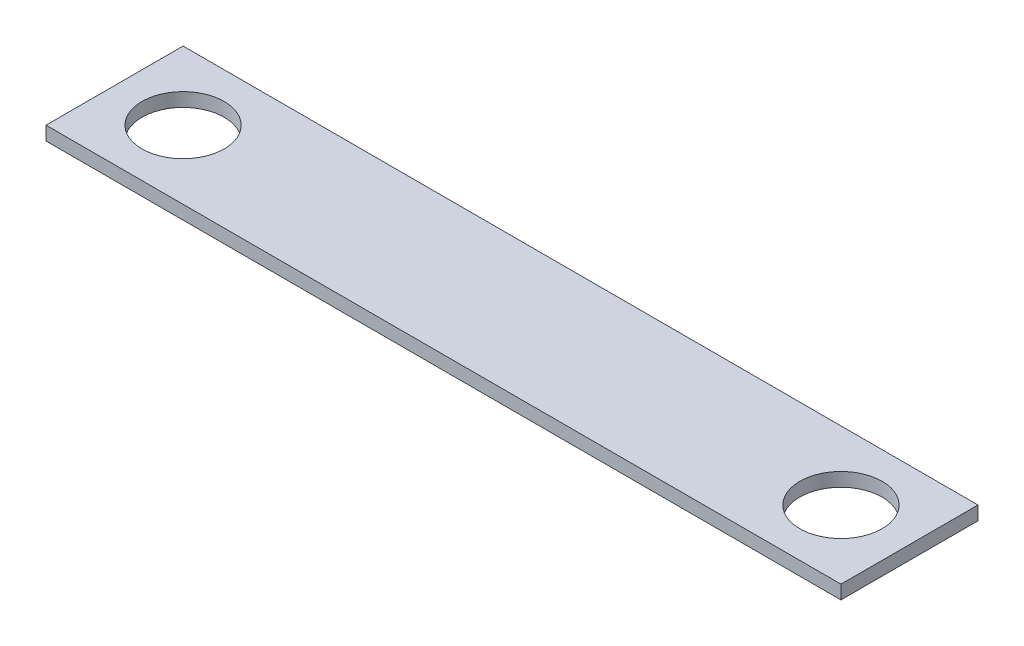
from build123d import *

# Parameters (mm, degrees)
SKETCH_1_W          = 29
SKETCH_1_H          = 5
EXTRUDE_1_DEPTH     = 0.5
SKETCH_2_R          = 1.5
CUT_EXTRUDE_1_DEPTH = 30.432125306


with BuildPart() as part:
    # Sketch 1 → Extrude 1 (new body)
    with BuildSketch(Plane(origin=(0, 0, 0), x_dir=(1, 0, 0), z_dir=(0, 1, 0))):
        with Locations((14.5, 2.5)):
            Rectangle(SKETCH_1_W, SKETCH_1_H)
    extrude(amount=EXTRUDE_1_DEPTH)

    # Sketch 2 → Cut-Extrude 1 (cut, through all)
    with BuildSketch(Plane(origin=(0, 0.5, 0), x_dir=(1, 0, 0), z_dir=(0, 1, 0))):
        with Locations(Location((2.5, 2.5, 0), (0, 0, 270))):
            Circle(SKETCH_2_R)
        with Locations(Location((26.5, 2.5, 0), (0, 0, 90))):
            Circle(SKETCH_2_R)
    extrude(amount=-CUT_EXTRUDE_1_DEPTH, mode=Mode.SUBTRACT)


solid = part.part
